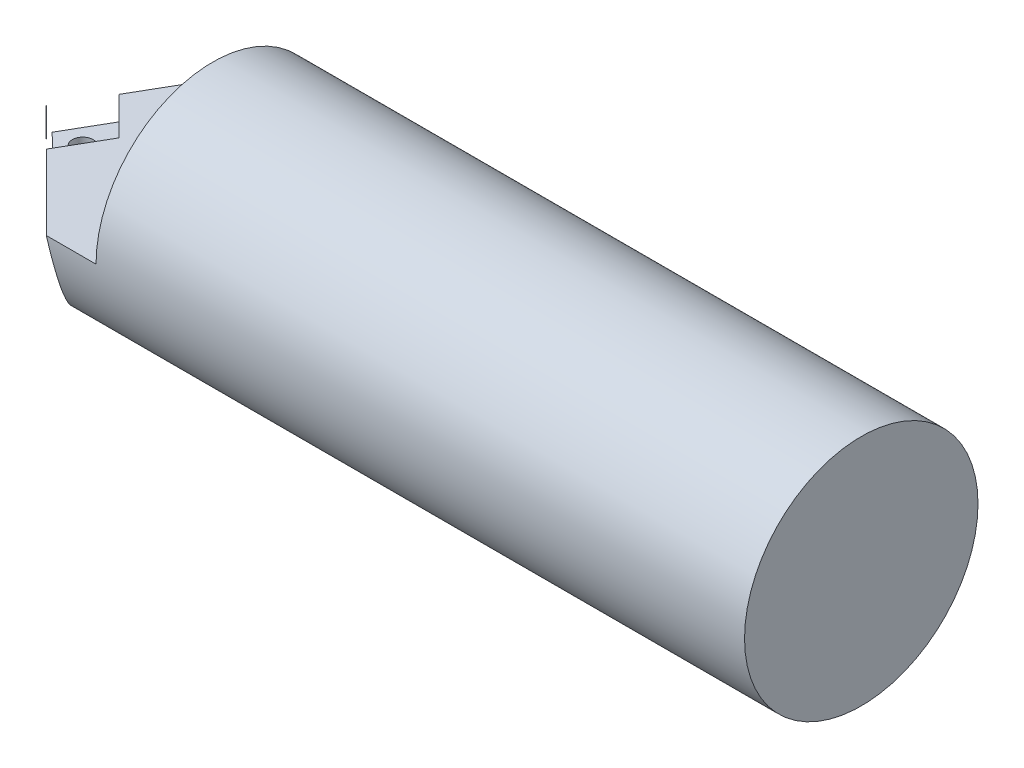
ISO-10303-21;
HEADER;
FILE_DESCRIPTION(('STEP AP214'),'2;1');
FILE_NAME('part.step','',(''),(''),'','','');
FILE_SCHEMA(('AUTOMOTIVE_DESIGN { 1 0 10303 214 1 1 1 1 }'));
ENDSEC;
DATA;
#1=APPLICATION_CONTEXT('core data for automotive mechanical design processes');
#2=APPLICATION_PROTOCOL_DEFINITION('international standard','automotive_design',2000,#1);
#3=PRODUCT_CONTEXT('',#1,'mechanical');
#4=PRODUCT('Part','Part','',(#3));
#5=PRODUCT_RELATED_PRODUCT_CATEGORY('part','',(#4));
#6=PRODUCT_DEFINITION_FORMATION('','',#4);
#7=PRODUCT_DEFINITION_CONTEXT('part definition',#1,'design');
#8=PRODUCT_DEFINITION('design','',#6,#7);
#9=PRODUCT_DEFINITION_SHAPE('','',#8);
#10=(LENGTH_UNIT() NAMED_UNIT(*) SI_UNIT(.MILLI.,.METRE.));
#11=(NAMED_UNIT(*) PLANE_ANGLE_UNIT() SI_UNIT($,.RADIAN.));
#12=(NAMED_UNIT(*) SI_UNIT($,.STERADIAN.) SOLID_ANGLE_UNIT());
#13=UNCERTAINTY_MEASURE_WITH_UNIT(LENGTH_MEASURE(1.E-05),#10,'distance_accuracy_value','');
#14=(GEOMETRIC_REPRESENTATION_CONTEXT(3) GLOBAL_UNCERTAINTY_ASSIGNED_CONTEXT((#13)) GLOBAL_UNIT_ASSIGNED_CONTEXT((#10,
#11,#12)) REPRESENTATION_CONTEXT('',''));
#15=CARTESIAN_POINT('',(0.,0.,0.));
#16=DIRECTION('',(0.,0.,1.));
#17=DIRECTION('',(1.,0.,0.));
#18=AXIS2_PLACEMENT_3D('',#15,#16,#17);
#19=CARTESIAN_POINT('',(62.5,0.,0.));
#20=DIRECTION('',(-1.,0.,0.));
#21=DIRECTION('',(0.,0.,1.));
#22=AXIS2_PLACEMENT_3D('',#19,#20,#21);
#23=CYLINDRICAL_SURFACE('',#22,18.);
#24=CARTESIAN_POINT('',(62.5,0.,0.));
#25=DIRECTION('',(1.,0.,0.));
#26=DIRECTION('',(0.,0.,-1.));
#27=AXIS2_PLACEMENT_3D('',#24,#25,#26);
#28=CIRCLE('',#27,18.);
#29=CARTESIAN_POINT('',(62.5,0.,-18.));
#30=VERTEX_POINT('',#29);
#31=EDGE_CURVE('E199',#30,#30,#28,.T.);
#32=ORIENTED_EDGE('',*,*,#31,.F.);
#33=EDGE_LOOP('',(#32));
#34=FACE_BOUND('',#33,.T.);
#35=CARTESIAN_POINT('',(-63.2211402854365,0.,0.));
#36=DIRECTION('',(0.688628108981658,0.20791169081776,-0.694668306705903));
#37=DIRECTION('',(-0.725114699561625,0.197449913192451,-0.659713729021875));
#38=AXIS2_PLACEMENT_3D('',#35,#36,#37);
#39=ELLIPSE('',#38,26.1389271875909,18.);
#40=CARTESIAN_POINT('',(-54.0606440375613,-17.5908617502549,3.81596421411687));
#41=VERTEX_POINT('',#40);
#42=CARTESIAN_POINT('',(-56.5442582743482,-17.956935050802,1.24438080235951));
#43=VERTEX_POINT('',#42);
#44=EDGE_CURVE('E134',#41,#43,#39,.T.);
#45=ORIENTED_EDGE('',*,*,#44,.T.);
#46=CARTESIAN_POINT('',(-58.4633093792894,-17.9519952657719,1.31372218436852));
#47=CARTESIAN_POINT('',(-58.4264346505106,-17.9501189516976,1.33935729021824));
#48=CARTESIAN_POINT('',(-58.388495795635,-17.9483026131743,1.36342879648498));
#49=CARTESIAN_POINT('',(-58.3107255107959,-17.9448375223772,1.40830192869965));
#50=CARTESIAN_POINT('',(-58.2708941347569,-17.9431887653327,1.42910364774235));
#51=CARTESIAN_POINT('',(-58.1490326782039,-17.9385697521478,1.4863352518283));
#52=CARTESIAN_POINT('',(-58.0645239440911,-17.9359208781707,1.51766883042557));
#53=CARTESIAN_POINT('',(-57.8914170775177,-17.9317893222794,1.56573269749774));
#54=CARTESIAN_POINT('',(-57.8028166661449,-17.9303072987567,1.58245474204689));
#55=CARTESIAN_POINT('',(-57.6240647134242,-17.9286783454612,1.60080593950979));
#56=CARTESIAN_POINT('',(-57.5339135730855,-17.9285310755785,1.60243893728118));
#57=CARTESIAN_POINT('',(-57.3548258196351,-17.9295869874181,1.59057985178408));
#58=CARTESIAN_POINT('',(-57.2658869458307,-17.9307871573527,1.57712150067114));
#59=CARTESIAN_POINT('',(-57.0915214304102,-17.9343971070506,1.53552330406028));
#60=CARTESIAN_POINT('',(-57.0060953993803,-17.9368070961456,1.50738091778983));
#61=CARTESIAN_POINT('',(-56.8411211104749,-17.9425667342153,1.43719605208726));
#62=CARTESIAN_POINT('',(-56.7615771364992,-17.9459170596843,1.39514356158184));
#63=CARTESIAN_POINT('',(-56.6106675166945,-17.9531795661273,1.29834144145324));
#64=CARTESIAN_POINT('',(-56.5393015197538,-17.9570917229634,1.2435923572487));
#65=CARTESIAN_POINT('',(-56.4064985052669,-17.9650543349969,1.12271754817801));
#66=CARTESIAN_POINT('',(-56.3450977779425,-17.9691052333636,1.05655197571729));
#67=CARTESIAN_POINT('',(-56.234263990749,-17.9768766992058,0.914839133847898));
#68=CARTESIAN_POINT('',(-56.1848312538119,-17.9805972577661,0.839291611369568));
#69=CARTESIAN_POINT('',(-56.0993065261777,-17.9872923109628,0.680879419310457));
#70=CARTESIAN_POINT('',(-56.0632251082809,-17.9902662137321,0.598009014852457));
#71=CARTESIAN_POINT('',(-56.0054995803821,-17.9951284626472,0.427354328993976));
#72=CARTESIAN_POINT('',(-55.9838550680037,-17.9970168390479,0.339570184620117));
#73=CARTESIAN_POINT('',(-55.9556779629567,-17.9994906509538,0.161876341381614));
#74=CARTESIAN_POINT('',(-55.9490977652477,-18.0000801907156,0.0719742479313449));
#75=CARTESIAN_POINT('',(-55.9511012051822,-17.9999021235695,-0.107658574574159));
#76=CARTESIAN_POINT('',(-55.9596846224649,-17.9991345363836,-0.197389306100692));
#77=CARTESIAN_POINT('',(-55.9917289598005,-17.9963317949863,-0.373928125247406));
#78=CARTESIAN_POINT('',(-56.0151572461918,-17.9942994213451,-0.460742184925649));
#79=CARTESIAN_POINT('',(-56.0761860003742,-17.9891970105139,-0.629204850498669));
#80=CARTESIAN_POINT('',(-56.1137867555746,-17.9861269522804,-0.710853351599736));
#81=CARTESIAN_POINT('',(-56.2021869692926,-17.9792842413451,-0.86686580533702));
#82=CARTESIAN_POINT('',(-56.2530151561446,-17.9755100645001,-0.941213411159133));
#83=CARTESIAN_POINT('',(-56.3663944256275,-17.9676857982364,-1.08033826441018));
#84=CARTESIAN_POINT('',(-56.4289455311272,-17.9636357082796,-1.14511549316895));
#85=CARTESIAN_POINT('',(-56.5642323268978,-17.9557003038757,-1.26347341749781));
#86=CARTESIAN_POINT('',(-56.636999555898,-17.9518155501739,-1.31701810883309));
#87=CARTESIAN_POINT('',(-56.7905226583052,-17.944663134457,-1.41113475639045));
#88=CARTESIAN_POINT('',(-56.8712789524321,-17.9413955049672,-1.45170602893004));
#89=CARTESIAN_POINT('',(-57.0384309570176,-17.9358506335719,-1.51868275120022));
#90=CARTESIAN_POINT('',(-57.12482248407,-17.9335726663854,-1.54509857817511));
#91=CARTESIAN_POINT('',(-57.3008258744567,-17.930263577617,-1.58303982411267));
#92=CARTESIAN_POINT('',(-57.390437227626,-17.9292322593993,-1.59456759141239));
#93=CARTESIAN_POINT('',(-57.5700100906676,-17.9285350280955,-1.60238801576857));
#94=CARTESIAN_POINT('',(-57.6599692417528,-17.9288642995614,-1.5987344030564));
#95=CARTESIAN_POINT('',(-57.8379983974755,-17.930839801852,-1.57642256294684));
#96=CARTESIAN_POINT('',(-57.9260681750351,-17.9324861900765,-1.55776254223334));
#97=CARTESIAN_POINT('',(-58.0923099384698,-17.9367678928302,-1.50762740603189));
#98=CARTESIAN_POINT('',(-58.170754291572,-17.9393328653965,-1.47705277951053));
#99=CARTESIAN_POINT('',(-58.2840308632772,-17.9437277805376,-1.42230954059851));
#100=CARTESIAN_POINT('',(-58.3210719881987,-17.9452847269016,-1.40257191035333));
#101=CARTESIAN_POINT('',(-58.3934887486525,-17.9485421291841,-1.36025157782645));
#102=CARTESIAN_POINT('',(-58.4288642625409,-17.9502425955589,-1.33766866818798));
#103=CARTESIAN_POINT('',(-58.4633093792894,-17.9519952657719,-1.31372218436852));
#104=B_SPLINE_CURVE_WITH_KNOTS('',3,(#46,#47,#48,#49,#50,#51,#52,#53,#54,#55,#56,#57,#58,#59,
#60,#61,#62,#63,#64,#65,#66,#67,#68,#69,#70,#71,#72,#73,#74,#75,#76,#77,#78,#79,#80,#81,#82,#83,
#84,#85,#86,#87,#88,#89,#90,#91,#92,#93,#94,#95,#96,#97,#98,#99,#100,#101,#102,#103),
.UNSPECIFIED.,.F.,.F.,(4,2,2,2,2,2,2,2,2,2,2,2,2,2,2,2,2,2,2,2,2,2,2,2,2,2,2,2,4),(0.,
0.134765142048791,0.26952644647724,0.538647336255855,0.807919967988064,1.07712398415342,
1.34572747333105,1.61437745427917,1.88322120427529,2.15205340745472,2.42184364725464,
2.69164116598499,2.96165188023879,3.2316550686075,3.50080382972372,3.76994867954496,
4.03850390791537,4.30706458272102,4.57621347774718,4.84536289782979,5.11536228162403,
5.3853758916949,5.65519128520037,5.92496411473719,6.19378297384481,6.46263396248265,
6.71420969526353,6.84009824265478,6.96599596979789),.UNSPECIFIED.);
#105=CARTESIAN_POINT('',(-56.8894066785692,-17.940913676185,-1.45726334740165));
#106=VERTEX_POINT('',#105);
#107=EDGE_CURVE('E140',#43,#106,#104,.T.);
#108=ORIENTED_EDGE('',*,*,#107,.T.);
#109=CARTESIAN_POINT('',(-62.1341611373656,0.,0.));
#110=DIRECTION('',(0.847100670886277,0.20791169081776,0.489073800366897));
#111=DIRECTION('',(-0.531432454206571,0.33141019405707,0.779581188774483));
#112=AXIS2_PLACEMENT_3D('',#109,#110,#111);
#113=ELLIPSE('',#112,21.248950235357,18.);
#114=CARTESIAN_POINT('',(-51.7418562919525,0.,-18.));
#115=VERTEX_POINT('',#114);
#116=EDGE_CURVE('E132',#106,#115,#113,.T.);
#117=ORIENTED_EDGE('',*,*,#116,.T.);
#118=DIRECTION('',(-1.,0.,0.));
#119=VECTOR('',#118,1.);
#120=CARTESIAN_POINT('',(-62.5,0.,-18.));
#121=LINE('',#120,#119);
#122=CARTESIAN_POINT('',(-37.5,0.,-18.));
#123=VERTEX_POINT('',#122);
#124=EDGE_CURVE('E169',#123,#115,#121,.T.);
#125=ORIENTED_EDGE('',*,*,#124,.F.);
#126=CARTESIAN_POINT('',(-37.5,0.,0.));
#127=DIRECTION('',(-1.,0.,0.));
#128=DIRECTION('',(0.,0.,1.));
#129=AXIS2_PLACEMENT_3D('',#126,#127,#128);
#130=CIRCLE('',#129,18.);
#131=CARTESIAN_POINT('',(-37.5,0.,18.));
#132=VERTEX_POINT('',#131);
#133=EDGE_CURVE('E196',#132,#123,#130,.T.);
#134=ORIENTED_EDGE('',*,*,#133,.F.);
#135=DIRECTION('',(1.,0.,0.));
#136=VECTOR('',#135,1.);
#137=CARTESIAN_POINT('',(-62.5,0.,18.));
#138=LINE('',#137,#136);
#139=CARTESIAN_POINT('',(-45.1644278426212,0.,18.));
#140=VERTEX_POINT('',#139);
#141=EDGE_CURVE('E177',#140,#132,#138,.T.);
#142=ORIENTED_EDGE('',*,*,#141,.F.);
#143=CARTESIAN_POINT('',(-63.1644278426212,0.,0.));
#144=DIRECTION('',(0.691654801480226,0.20791169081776,-0.691654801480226));
#145=DIRECTION('',(-0.7222282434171,0.199110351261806,-0.662375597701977));
#146=AXIS2_PLACEMENT_3D('',#143,#144,#145);
#147=ELLIPSE('',#146,26.0245428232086,18.);
#148=EDGE_CURVE('E73',#140,#41,#147,.T.);
#149=ORIENTED_EDGE('',*,*,#148,.T.);
#150=EDGE_LOOP('',(#45,#108,#117,#125,#134,#142,#149));
#151=FACE_BOUND('',#150,.T.);
#152=ADVANCED_FACE('F49',(#34,#151),#23,.T.);
#153=CARTESIAN_POINT('',(62.5,0.,0.));
#154=DIRECTION('',(1.,0.,0.));
#155=DIRECTION('',(0.,0.,-1.));
#156=AXIS2_PLACEMENT_3D('',#153,#154,#155);
#157=PLANE('',#156);
#158=ORIENTED_EDGE('',*,*,#31,.T.);
#159=EDGE_LOOP('',(#158));
#160=FACE_BOUND('',#159,.T.);
#161=ADVANCED_FACE('F221',(#160),#157,.T.);
#162=CARTESIAN_POINT('',(-37.5,18.,-18.));
#163=DIRECTION('',(-1.,0.,0.));
#164=DIRECTION('',(0.,0.,1.));
#165=AXIS2_PLACEMENT_3D('',#162,#163,#164);
#166=PLANE('',#165);
#167=ORIENTED_EDGE('',*,*,#133,.T.);
#168=DIRECTION('',(0.,0.,-1.));
#169=VECTOR('',#168,1.);
#170=CARTESIAN_POINT('',(-37.5,0.,-18.));
#171=LINE('',#170,#169);
#172=EDGE_CURVE('E172',#132,#123,#171,.T.);
#173=ORIENTED_EDGE('',*,*,#172,.F.);
#174=EDGE_LOOP('',(#167,#173));
#175=FACE_BOUND('',#174,.T.);
#176=ADVANCED_FACE('F226',(#175),#166,.T.);
#177=CARTESIAN_POINT('',(0.,0.,0.));
#178=DIRECTION('',(0.,1.,0.));
#179=DIRECTION('',(0.,0.,1.));
#180=AXIS2_PLACEMENT_3D('',#177,#178,#179);
#181=PLANE('',#180);
#182=DIRECTION('',(-0.707106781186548,0.,-0.707106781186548));
#183=VECTOR('',#182,1.);
#184=CARTESIAN_POINT('',(-56.6987815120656,0.,6.46564633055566));
#185=LINE('',#184,#183);
#186=CARTESIAN_POINT('',(-56.6987815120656,0.,6.46564633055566));
#187=VERTEX_POINT('',#186);
#188=EDGE_CURVE('E58',#140,#187,#185,.T.);
#189=ORIENTED_EDGE('',*,*,#188,.F.);
#190=ORIENTED_EDGE('',*,*,#141,.T.);
#191=ORIENTED_EDGE('',*,*,#172,.T.);
#192=ORIENTED_EDGE('',*,*,#124,.T.);
#193=DIRECTION('',(0.499999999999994,0.,-0.866025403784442));
#194=VECTOR('',#193,1.);
#195=CARTESIAN_POINT('',(-58.4012184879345,0.,-6.46564633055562));
#196=LINE('',#195,#194);
#197=CARTESIAN_POINT('',(-58.4012184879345,0.,-6.46564633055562));
#198=VERTEX_POINT('',#197);
#199=EDGE_CURVE('E126',#198,#115,#196,.T.);
#200=ORIENTED_EDGE('',*,*,#199,.F.);
#201=DIRECTION('',(-0.707106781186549,0.,-0.707106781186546));
#202=VECTOR('',#201,1.);
#203=CARTESIAN_POINT('',(-52.5887350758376,0.,-0.653162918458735));
#204=LINE('',#203,#202);
#205=CARTESIAN_POINT('',(-52.5887350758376,0.,-0.653162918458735));
#206=VERTEX_POINT('',#205);
#207=EDGE_CURVE('E161',#206,#198,#204,.T.);
#208=ORIENTED_EDGE('',*,*,#207,.F.);
#209=DIRECTION('',(0.499999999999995,0.,-0.866025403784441));
#210=VECTOR('',#209,1.);
#211=CARTESIAN_POINT('',(-56.6987815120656,0.,6.46564633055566));
#212=LINE('',#211,#210);
#213=EDGE_CURVE('E143',#187,#206,#212,.T.);
#214=ORIENTED_EDGE('',*,*,#213,.F.);
#215=EDGE_LOOP('',(#189,#190,#191,#192,#200,#208,#214));
#216=FACE_BOUND('',#215,.T.);
#217=ADVANCED_FACE('F159',(#216),#181,.T.);
#218=CARTESIAN_POINT('',(0.,-3.18,0.));
#219=DIRECTION('',(0.,1.,0.));
#220=DIRECTION('',(0.,0.,1.));
#221=AXIS2_PLACEMENT_3D('',#218,#219,#220);
#222=PLANE('',#221);
#223=CARTESIAN_POINT('',(-57.55,-3.18,0.));
#224=DIRECTION('',(0.,1.,0.));
#225=DIRECTION('',(0.,0.,1.));
#226=AXIS2_PLACEMENT_3D('',#223,#224,#225);
#227=CIRCLE('',#226,1.6);
#228=CARTESIAN_POINT('',(-57.55,-3.18,1.6));
#229=VERTEX_POINT('',#228);
#230=EDGE_CURVE('E249',#229,#229,#227,.T.);
#231=ORIENTED_EDGE('',*,*,#230,.F.);
#232=EDGE_LOOP('',(#231));
#233=FACE_BOUND('',#232,.T.);
#234=DIRECTION('',(-0.710187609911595,0.,-0.704012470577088));
#235=VECTOR('',#234,1.);
#236=CARTESIAN_POINT('',(-30.8586556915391,-3.18,31.1293277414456));
#237=LINE('',#236,#235);
#238=CARTESIAN_POINT('',(-56.3493000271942,-3.18,5.86032664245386));
#239=VERTEX_POINT('',#238);
#240=CARTESIAN_POINT('',(-61.6839465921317,-3.18,0.572065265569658));
#241=VERTEX_POINT('',#240);
#242=EDGE_CURVE('E110',#239,#241,#237,.T.);
#243=ORIENTED_EDGE('',*,*,#242,.F.);
#244=DIRECTION('',(0.499999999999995,0.,-0.866025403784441));
#245=VECTOR('',#244,1.);
#246=CARTESIAN_POINT('',(-56.6987815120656,-3.18,6.46564633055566));
#247=LINE('',#246,#245);
#248=CARTESIAN_POINT('',(-52.5887350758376,-3.18,-0.653162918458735));
#249=VERTEX_POINT('',#248);
#250=EDGE_CURVE('E155',#239,#249,#247,.T.);
#251=ORIENTED_EDGE('',*,*,#250,.T.);
#252=DIRECTION('',(-0.707106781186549,0.,-0.707106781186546));
#253=VECTOR('',#252,1.);
#254=CARTESIAN_POINT('',(-52.5887350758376,-3.18,-0.653162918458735));
#255=LINE('',#254,#253);
#256=CARTESIAN_POINT('',(-57.9064034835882,-3.18,-5.97083132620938));
#257=VERTEX_POINT('',#256);
#258=EDGE_CURVE('E124',#249,#257,#255,.T.);
#259=ORIENTED_EDGE('',*,*,#258,.T.);
#260=DIRECTION('',(0.499999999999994,0.,-0.866025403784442));
#261=VECTOR('',#260,1.);
#262=CARTESIAN_POINT('',(-46.0152484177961,-3.18,-26.5669160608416));
#263=LINE('',#262,#261);
#264=EDGE_CURVE('E94',#241,#257,#263,.T.);
#265=ORIENTED_EDGE('',*,*,#264,.F.);
#266=EDGE_LOOP('',(#243,#251,#259,#265));
#267=FACE_BOUND('',#266,.T.);
#268=ADVANCED_FACE('F122',(#233,#267),#222,.T.);
#269=CARTESIAN_POINT('',(-52.5887350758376,-3.18,-0.653162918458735));
#270=DIRECTION('',(0.707106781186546,0.,-0.707106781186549));
#271=DIRECTION('',(-0.707106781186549,0.,-0.707106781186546));
#272=AXIS2_PLACEMENT_3D('',#269,#270,#271);
#273=PLANE('',#272);
#274=ORIENTED_EDGE('',*,*,#207,.T.);
#275=DIRECTION('',(0.15196628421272,-0.976633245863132,0.15196628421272));
#276=VECTOR('',#275,1.);
#277=CARTESIAN_POINT('',(-57.6607936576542,-4.7584469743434,-5.7252215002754));
#278=LINE('',#277,#276);
#279=EDGE_CURVE('E89',#198,#257,#278,.T.);
#280=ORIENTED_EDGE('',*,*,#279,.T.);
#281=ORIENTED_EDGE('',*,*,#258,.F.);
#282=DIRECTION('',(0.,1.,0.));
#283=VECTOR('',#282,1.);
#284=CARTESIAN_POINT('',(-52.5887350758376,-3.18,-0.653162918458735));
#285=LINE('',#284,#283);
#286=EDGE_CURVE('E157',#249,#206,#285,.T.);
#287=ORIENTED_EDGE('',*,*,#286,.T.);
#288=EDGE_LOOP('',(#274,#280,#281,#287));
#289=FACE_BOUND('',#288,.T.);
#290=ADVANCED_FACE('F210',(#289),#273,.F.);
#291=CARTESIAN_POINT('',(-56.6987815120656,-3.18,6.46564633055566));
#292=DIRECTION('',(0.866025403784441,0.,0.499999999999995));
#293=DIRECTION('',(0.499999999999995,0.,-0.866025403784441));
#294=AXIS2_PLACEMENT_3D('',#291,#292,#293);
#295=PLANE('',#294);
#296=ORIENTED_EDGE('',*,*,#250,.F.);
#297=DIRECTION('',(-0.10733757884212,0.97668550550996,0.185914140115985));
#298=VECTOR('',#297,1.);
#299=CARTESIAN_POINT('',(-56.3654060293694,-3.03344835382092,5.88822305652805));
#300=LINE('',#299,#298);
#301=EDGE_CURVE('E114',#239,#187,#300,.T.);
#302=ORIENTED_EDGE('',*,*,#301,.T.);
#303=ORIENTED_EDGE('',*,*,#213,.T.);
#304=ORIENTED_EDGE('',*,*,#286,.F.);
#305=EDGE_LOOP('',(#296,#302,#303,#304));
#306=FACE_BOUND('',#305,.T.);
#307=ADVANCED_FACE('F152',(#306),#295,.F.);
#308=CARTESIAN_POINT('',(-56.6987815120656,0.,6.46564633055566));
#309=DIRECTION('',(0.688628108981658,0.20791169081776,-0.694668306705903));
#310=DIRECTION('',(-0.710187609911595,0.,-0.704012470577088));
#311=AXIS2_PLACEMENT_3D('',#308,#309,#310);
#312=PLANE('',#311);
#313=DIRECTION('',(-0.256907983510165,0.965823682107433,0.0343933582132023));
#314=VECTOR('',#313,1.);
#315=CARTESIAN_POINT('',(-62.1941426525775,-1.26196136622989,0.640367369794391));
#316=LINE('',#315,#314);
#317=CARTESIAN_POINT('',(-59.1332953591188,-12.7689560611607,0.230598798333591));
#318=VERTEX_POINT('',#317);
#319=EDGE_CURVE('E104',#318,#241,#316,.T.);
#320=ORIENTED_EDGE('',*,*,#319,.F.);
#321=CARTESIAN_POINT('',(-57.55,-18.7834873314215,0.));
#322=DIRECTION('',(0.688628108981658,0.20791169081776,-0.694668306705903));
#323=DIRECTION('',(-0.146372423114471,0.978147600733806,0.147656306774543));
#324=AXIS2_PLACEMENT_3D('',#321,#322,#323);
#325=ELLIPSE('',#324,7.69557495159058,1.6);
#326=EDGE_CURVE('E65',#318,#43,#325,.T.);
#327=ORIENTED_EDGE('',*,*,#326,.T.);
#328=ORIENTED_EDGE('',*,*,#44,.F.);
#329=DIRECTION('',(-0.146694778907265,0.978147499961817,0.147336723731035));
#330=VECTOR('',#329,1.);
#331=CARTESIAN_POINT('',(-56.6987815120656,0.,6.46564633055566));
#332=LINE('',#331,#330);
#333=EDGE_CURVE('E119',#41,#187,#332,.T.);
#334=ORIENTED_EDGE('',*,*,#333,.T.);
#335=ORIENTED_EDGE('',*,*,#301,.F.);
#336=ORIENTED_EDGE('',*,*,#242,.T.);
#337=EDGE_LOOP('',(#320,#327,#328,#334,#335,#336));
#338=FACE_BOUND('',#337,.T.);
#339=ADVANCED_FACE('F51',(#338),#312,.F.);
#340=CARTESIAN_POINT('',(-58.4012184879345,0.,-6.46564633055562));
#341=DIRECTION('',(0.847100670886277,0.20791169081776,0.489073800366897));
#342=DIRECTION('',(0.499999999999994,0.,-0.866025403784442));
#343=AXIS2_PLACEMENT_3D('',#340,#341,#342);
#344=PLANE('',#343);
#345=ORIENTED_EDGE('',*,*,#116,.F.);
#346=CARTESIAN_POINT('',(-57.55,-18.6773815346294,0.));
#347=DIRECTION('',(0.847100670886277,0.20791169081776,0.489073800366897));
#348=DIRECTION('',(-0.180056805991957,0.978147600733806,-0.103955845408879));
#349=AXIS2_PLACEMENT_3D('',#346,#347,#348);
#350=ELLIPSE('',#349,7.69557495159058,1.6);
#351=EDGE_CURVE('E12',#106,#318,#350,.T.);
#352=ORIENTED_EDGE('',*,*,#351,.T.);
#353=ORIENTED_EDGE('',*,*,#319,.T.);
#354=ORIENTED_EDGE('',*,*,#264,.T.);
#355=ORIENTED_EDGE('',*,*,#279,.F.);
#356=ORIENTED_EDGE('',*,*,#199,.T.);
#357=EDGE_LOOP('',(#345,#352,#353,#354,#355,#356));
#358=FACE_BOUND('',#357,.T.);
#359=ADVANCED_FACE('F107',(#358),#344,.F.);
#360=CARTESIAN_POINT('',(-56.6987815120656,0.,6.46564633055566));
#361=DIRECTION('',(0.691654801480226,0.20791169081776,-0.691654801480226));
#362=DIRECTION('',(-0.707106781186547,0.,-0.707106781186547));
#363=AXIS2_PLACEMENT_3D('',#360,#361,#362);
#364=PLANE('',#363);
#365=ORIENTED_EDGE('',*,*,#188,.T.);
#366=ORIENTED_EDGE('',*,*,#333,.F.);
#367=ORIENTED_EDGE('',*,*,#148,.F.);
#368=EDGE_LOOP('',(#365,#366,#367));
#369=FACE_BOUND('',#368,.T.);
#370=ADVANCED_FACE('F145',(#369),#364,.F.);
#371=CARTESIAN_POINT('',(-57.55,-18.,0.));
#372=DIRECTION('',(0.,1.,0.));
#373=DIRECTION('',(0.,0.,1.));
#374=AXIS2_PLACEMENT_3D('',#371,#372,#373);
#375=CYLINDRICAL_SURFACE('',#374,1.6);
#376=ORIENTED_EDGE('',*,*,#230,.T.);
#377=EDGE_LOOP('',(#376));
#378=FACE_BOUND('',#377,.T.);
#379=ORIENTED_EDGE('',*,*,#326,.F.);
#380=ORIENTED_EDGE('',*,*,#351,.F.);
#381=ORIENTED_EDGE('',*,*,#107,.F.);
#382=EDGE_LOOP('',(#379,#380,#381));
#383=FACE_BOUND('',#382,.T.);
#384=ADVANCED_FACE('F229',(#378,#383),#375,.F.);
#385=CLOSED_SHELL('',(#152,#161,#176,#217,#268,#290,#307,#339,#359,#370,#384));
#386=MANIFOLD_SOLID_BREP('B2',#385);
#387=CARTESIAN_POINT('',(-62.5112649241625,-3.18,0.653162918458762));
#388=DIRECTION('',(-0.707106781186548,0.,0.707106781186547));
#389=DIRECTION('',(0.707106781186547,0.,0.707106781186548));
#390=AXIS2_PLACEMENT_3D('',#387,#388,#389);
#391=PLANE('',#390);
#392=DIRECTION('',(0.707106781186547,0.,0.707106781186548));
#393=VECTOR('',#392,1.);
#394=CARTESIAN_POINT('',(-31.5822139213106,0.,31.5822139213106));
#395=LINE('',#394,#393);
#396=CARTESIAN_POINT('',(-62.5,0.,0.664427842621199));
#397=VERTEX_POINT('',#396);
#398=CARTESIAN_POINT('',(-56.6987815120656,0.,6.46564633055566));
#399=VERTEX_POINT('',#398);
#400=EDGE_CURVE('E47',#397,#399,#395,.T.);
#401=ORIENTED_EDGE('',*,*,#400,.T.);
#402=DIRECTION('',(-0.70695762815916,-0.0205383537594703,-0.70695762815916));
#403=VECTOR('',#402,1.);
#404=CARTESIAN_POINT('',(-62.5549858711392,-0.170132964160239,0.609441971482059));
#405=LINE('',#404,#403);
#406=CARTESIAN_POINT('',(-62.4851077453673,-0.168102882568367,0.679320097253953));
#407=VERTEX_POINT('',#406);
#408=EDGE_CURVE('E341',#399,#407,#405,.T.);
#409=ORIENTED_EDGE('',*,*,#408,.T.);
#410=DIRECTION('',(-0.15196628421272,0.976633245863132,-0.15196628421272));
#411=VECTOR('',#410,1.);
#412=CARTESIAN_POINT('',(-62.0393041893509,-3.033123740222,1.12512365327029));
#413=LINE('',#412,#411);
#414=CARTESIAN_POINT('',(-62.5,-0.0723956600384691,0.664427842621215));
#415=VERTEX_POINT('',#414);
#416=EDGE_CURVE('E372',#407,#415,#413,.T.);
#417=ORIENTED_EDGE('',*,*,#416,.T.);
#418=DIRECTION('',(0.,-1.,0.));
#419=VECTOR('',#418,1.);
#420=CARTESIAN_POINT('',(-62.5,0.,0.664427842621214));
#421=LINE('',#420,#419);
#422=EDGE_CURVE('E375',#397,#415,#421,.T.);
#423=ORIENTED_EDGE('',*,*,#422,.F.);
#424=EDGE_LOOP('',(#401,#409,#417,#423));
#425=FACE_BOUND('',#424,.T.);
#426=ADVANCED_FACE('F326',(#425),#391,.F.);
#427=CARTESIAN_POINT('',(0.,0.,0.));
#428=DIRECTION('',(0.,1.,0.));
#429=DIRECTION('',(0.,0.,1.));
#430=AXIS2_PLACEMENT_3D('',#427,#428,#429);
#431=PLANE('',#430);
#432=DIRECTION('',(-0.710187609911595,0.,-0.704012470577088));
#433=VECTOR('',#432,1.);
#434=CARTESIAN_POINT('',(-56.6987815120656,0.,6.46564633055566));
#435=LINE('',#434,#433);
#436=CARTESIAN_POINT('',(-62.5,0.,0.714869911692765));
#437=VERTEX_POINT('',#436);
#438=EDGE_CURVE('E360',#399,#437,#435,.T.);
#439=ORIENTED_EDGE('',*,*,#438,.F.);
#440=ORIENTED_EDGE('',*,*,#400,.F.);
#441=DIRECTION('',(0.,0.,1.));
#442=VECTOR('',#441,1.);
#443=CARTESIAN_POINT('',(-62.5,0.,-18.));
#444=LINE('',#443,#442);
#445=EDGE_CURVE('E334',#397,#437,#444,.T.);
#446=ORIENTED_EDGE('',*,*,#445,.T.);
#447=EDGE_LOOP('',(#439,#440,#446));
#448=FACE_BOUND('',#447,.T.);
#449=ADVANCED_FACE('F374',(#448),#431,.T.);
#450=CARTESIAN_POINT('',(-62.5,0.,0.));
#451=DIRECTION('',(1.,0.,0.));
#452=DIRECTION('',(0.,0.,-1.));
#453=AXIS2_PLACEMENT_3D('',#450,#451,#452);
#454=PLANE('',#453);
#455=DIRECTION('',(0.,-0.920293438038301,0.391228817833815));
#456=VECTOR('',#455,1.);
#457=CARTESIAN_POINT('',(-62.5,0.228143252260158,0.536664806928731));
#458=LINE('',#457,#456);
#459=CARTESIAN_POINT('',(-62.5,-0.112116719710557,0.681313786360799));
#460=VERTEX_POINT('',#459);
#461=EDGE_CURVE('E348',#415,#460,#458,.T.);
#462=ORIENTED_EDGE('',*,*,#461,.T.);
#463=DIRECTION('',(0.,0.958011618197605,0.286729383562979));
#464=VECTOR('',#463,1.);
#465=CARTESIAN_POINT('',(-62.5,-0.196367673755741,0.656097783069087));
#466=LINE('',#465,#464);
#467=EDGE_CURVE('E363',#460,#437,#466,.T.);
#468=ORIENTED_EDGE('',*,*,#467,.T.);
#469=ORIENTED_EDGE('',*,*,#445,.F.);
#470=ORIENTED_EDGE('',*,*,#422,.T.);
#471=EDGE_LOOP('',(#462,#468,#469,#470));
#472=FACE_BOUND('',#471,.T.);
#473=ADVANCED_FACE('F328',(#472),#454,.F.);
#474=CARTESIAN_POINT('',(-58.4012184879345,0.,-6.46564633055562));
#475=DIRECTION('',(0.847100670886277,0.20791169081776,0.489073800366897));
#476=DIRECTION('',(0.499999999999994,0.,-0.866025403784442));
#477=AXIS2_PLACEMENT_3D('',#474,#475,#476);
#478=PLANE('',#477);
#479=ORIENTED_EDGE('',*,*,#416,.F.);
#480=DIRECTION('',(-0.256907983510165,0.965823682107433,0.0343933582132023));
#481=VECTOR('',#480,1.);
#482=CARTESIAN_POINT('',(-62.1941426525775,-1.26196136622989,0.640367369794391));
#483=LINE('',#482,#481);
#484=EDGE_CURVE('E367',#407,#460,#483,.T.);
#485=ORIENTED_EDGE('',*,*,#484,.T.);
#486=ORIENTED_EDGE('',*,*,#461,.F.);
#487=EDGE_LOOP('',(#479,#485,#486));
#488=FACE_BOUND('',#487,.T.);
#489=ADVANCED_FACE('F381',(#488),#478,.F.);
#490=CARTESIAN_POINT('',(-56.6987815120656,0.,6.46564633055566));
#491=DIRECTION('',(0.688628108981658,0.20791169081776,-0.694668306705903));
#492=DIRECTION('',(-0.710187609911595,0.,-0.704012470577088));
#493=AXIS2_PLACEMENT_3D('',#490,#491,#492);
#494=PLANE('',#493);
#495=ORIENTED_EDGE('',*,*,#484,.F.);
#496=ORIENTED_EDGE('',*,*,#408,.F.);
#497=ORIENTED_EDGE('',*,*,#438,.T.);
#498=ORIENTED_EDGE('',*,*,#467,.F.);
#499=EDGE_LOOP('',(#495,#496,#497,#498));
#500=FACE_BOUND('',#499,.T.);
#501=ADVANCED_FACE('F362',(#500),#494,.F.);
#502=CLOSED_SHELL('',(#426,#449,#473,#489,#501));
#503=MANIFOLD_SOLID_BREP('B6',#502);
#504=ADVANCED_BREP_SHAPE_REPRESENTATION('',(#18,#386,#503),#14);
#505=SHAPE_DEFINITION_REPRESENTATION(#9,#504);
ENDSEC;
END-ISO-10303-21;
